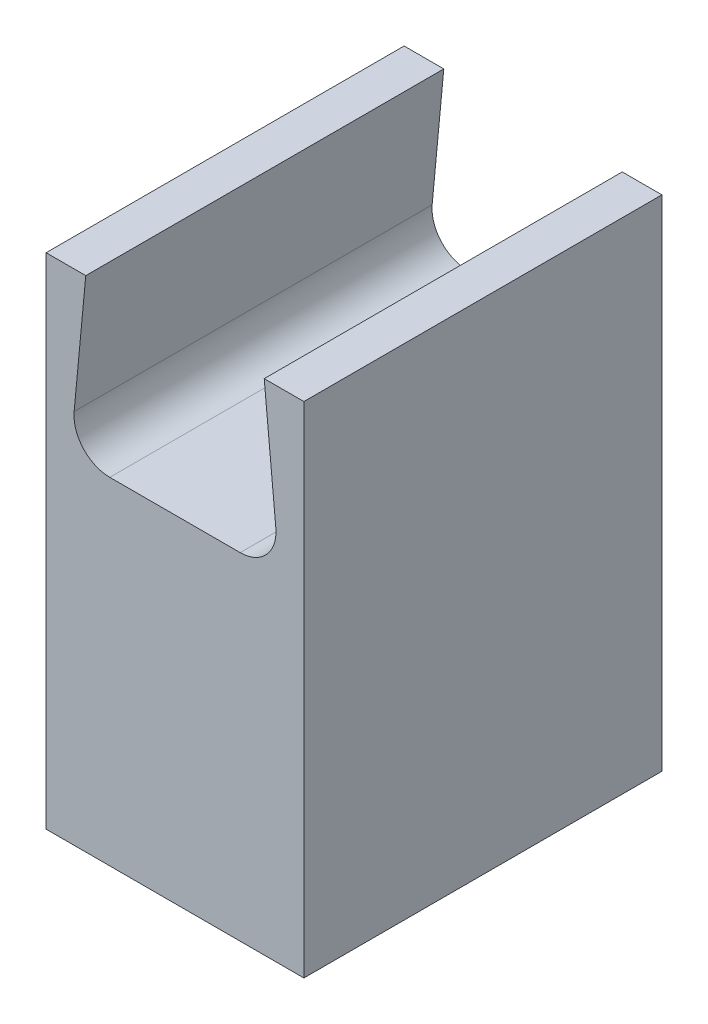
from build123d import *

# Parameters (mm, degrees)
SALIENTE_EXTRUIR1_DEPTH = 25
REDONDEO1_R             = 2.5


with BuildPart() as part:
    # Croquis1 → Saliente-Extruir1 (new body)
    with BuildSketch(Plane.XY):
        Polygon((-9, 4.26), (-9, -30.6), (9, -30.6), (9, 4.26), (6.23, 4.26), (7.3, -7.1), (-7.3, -7.1), (-6.23, 4.26), align=None)
    extrude(amount=SALIENTE_EXTRUIR1_DEPTH)

    # Redondeo1
    redondeo1_edges = [part.edges().sort_by_distance(p)[0] for p in [
        (-7.3, -7.1, 12.5),
        (7.3, -7.1, 12.5),
    ]]
    fillet(redondeo1_edges, radius=REDONDEO1_R)


solid = part.part
